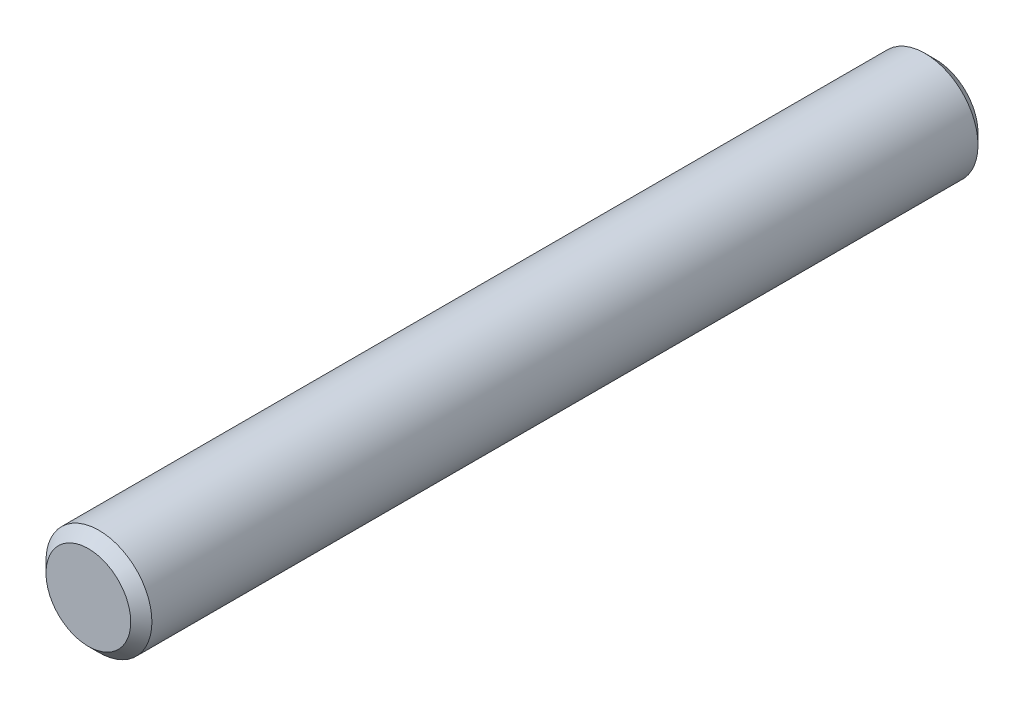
ISO-10303-21;
HEADER;
FILE_DESCRIPTION(('STEP AP214'),'2;1');
FILE_NAME('part.step','',(''),(''),'','','');
FILE_SCHEMA(('AUTOMOTIVE_DESIGN { 1 0 10303 214 1 1 1 1 }'));
ENDSEC;
DATA;
#1=APPLICATION_CONTEXT('core data for automotive mechanical design processes');
#2=APPLICATION_PROTOCOL_DEFINITION('international standard','automotive_design',2000,#1);
#3=PRODUCT_CONTEXT('',#1,'mechanical');
#4=PRODUCT('Part','Part','',(#3));
#5=PRODUCT_RELATED_PRODUCT_CATEGORY('part','',(#4));
#6=PRODUCT_DEFINITION_FORMATION('','',#4);
#7=PRODUCT_DEFINITION_CONTEXT('part definition',#1,'design');
#8=PRODUCT_DEFINITION('design','',#6,#7);
#9=PRODUCT_DEFINITION_SHAPE('','',#8);
#10=(LENGTH_UNIT() NAMED_UNIT(*) SI_UNIT(.MILLI.,.METRE.));
#11=(NAMED_UNIT(*) PLANE_ANGLE_UNIT() SI_UNIT($,.RADIAN.));
#12=(NAMED_UNIT(*) SI_UNIT($,.STERADIAN.) SOLID_ANGLE_UNIT());
#13=UNCERTAINTY_MEASURE_WITH_UNIT(LENGTH_MEASURE(1.E-05),#10,'distance_accuracy_value','');
#14=(GEOMETRIC_REPRESENTATION_CONTEXT(3) GLOBAL_UNCERTAINTY_ASSIGNED_CONTEXT((#13)) GLOBAL_UNIT_ASSIGNED_CONTEXT((#10,
#11,#12)) REPRESENTATION_CONTEXT('',''));
#15=CARTESIAN_POINT('',(0.,0.,0.));
#16=DIRECTION('',(0.,0.,1.));
#17=DIRECTION('',(1.,0.,0.));
#18=AXIS2_PLACEMENT_3D('',#15,#16,#17);
#19=CARTESIAN_POINT('',(0.,0.,20.));
#20=DIRECTION('',(0.,0.,-1.));
#21=DIRECTION('',(-1.,0.,0.));
#22=AXIS2_PLACEMENT_3D('',#19,#20,#21);
#23=CYLINDRICAL_SURFACE('',#22,2.5);
#24=CARTESIAN_POINT('',(0.,0.,-19.5));
#25=DIRECTION('',(0.,0.,1.));
#26=DIRECTION('',(1.,0.,0.));
#27=AXIS2_PLACEMENT_3D('',#24,#25,#26);
#28=CIRCLE('',#27,2.5);
#29=CARTESIAN_POINT('',(2.5,0.,-19.5));
#30=VERTEX_POINT('',#29);
#31=EDGE_CURVE('E53',#30,#30,#28,.T.);
#32=ORIENTED_EDGE('',*,*,#31,.T.);
#33=EDGE_LOOP('',(#32));
#34=FACE_BOUND('',#33,.T.);
#35=CARTESIAN_POINT('',(0.,0.,19.5));
#36=DIRECTION('',(0.,0.,1.));
#37=DIRECTION('',(1.,0.,0.));
#38=AXIS2_PLACEMENT_3D('',#35,#36,#37);
#39=CIRCLE('',#38,2.5);
#40=CARTESIAN_POINT('',(2.5,0.,19.5));
#41=VERTEX_POINT('',#40);
#42=EDGE_CURVE('E57',#41,#41,#39,.F.);
#43=ORIENTED_EDGE('',*,*,#42,.T.);
#44=EDGE_LOOP('',(#43));
#45=FACE_BOUND('',#44,.T.);
#46=ADVANCED_FACE('F42',(#34,#45),#23,.T.);
#47=CARTESIAN_POINT('',(0.,0.,20.));
#48=DIRECTION('',(0.,0.,1.));
#49=DIRECTION('',(1.,0.,0.));
#50=AXIS2_PLACEMENT_3D('',#47,#48,#49);
#51=PLANE('',#50);
#52=CARTESIAN_POINT('',(0.,0.,20.));
#53=DIRECTION('',(0.,0.,1.));
#54=DIRECTION('',(1.,0.,0.));
#55=AXIS2_PLACEMENT_3D('',#52,#53,#54);
#56=CIRCLE('',#55,1.99999999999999);
#57=CARTESIAN_POINT('',(1.99999999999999,0.,20.));
#58=VERTEX_POINT('',#57);
#59=EDGE_CURVE('E12',#58,#58,#56,.T.);
#60=ORIENTED_EDGE('',*,*,#59,.T.);
#61=EDGE_LOOP('',(#60));
#62=FACE_BOUND('',#61,.T.);
#63=ADVANCED_FACE('F73',(#62),#51,.T.);
#64=CARTESIAN_POINT('',(0.,0.,-20.));
#65=DIRECTION('',(0.,0.,1.));
#66=DIRECTION('',(1.,0.,0.));
#67=AXIS2_PLACEMENT_3D('',#64,#65,#66);
#68=PLANE('',#67);
#69=CARTESIAN_POINT('',(0.,0.,-20.));
#70=DIRECTION('',(0.,0.,1.));
#71=DIRECTION('',(1.,0.,0.));
#72=AXIS2_PLACEMENT_3D('',#69,#70,#71);
#73=CIRCLE('',#72,2.);
#74=CARTESIAN_POINT('',(2.,0.,-20.));
#75=VERTEX_POINT('',#74);
#76=EDGE_CURVE('E49',#75,#75,#73,.F.);
#77=ORIENTED_EDGE('',*,*,#76,.T.);
#78=EDGE_LOOP('',(#77));
#79=FACE_BOUND('',#78,.T.);
#80=ADVANCED_FACE('F70',(#79),#68,.F.);
#81=CARTESIAN_POINT('',(0.,0.,-19.5));
#82=DIRECTION('',(0.,0.,1.));
#83=DIRECTION('',(1.,0.,0.));
#84=AXIS2_PLACEMENT_3D('',#81,#82,#83);
#85=CONICAL_SURFACE('',#84,2.5,0.785398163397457);
#86=ORIENTED_EDGE('',*,*,#76,.F.);
#87=EDGE_LOOP('',(#86));
#88=FACE_BOUND('',#87,.T.);
#89=ORIENTED_EDGE('',*,*,#31,.F.);
#90=EDGE_LOOP('',(#89));
#91=FACE_BOUND('',#90,.T.);
#92=ADVANCED_FACE('F66',(#88,#91),#85,.T.);
#93=CARTESIAN_POINT('',(0.,0.,20.));
#94=DIRECTION('',(0.,0.,-1.));
#95=DIRECTION('',(-1.,0.,0.));
#96=AXIS2_PLACEMENT_3D('',#93,#94,#95);
#97=CONICAL_SURFACE('',#96,1.99999999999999,0.78539816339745);
#98=ORIENTED_EDGE('',*,*,#42,.F.);
#99=EDGE_LOOP('',(#98));
#100=FACE_BOUND('',#99,.T.);
#101=ORIENTED_EDGE('',*,*,#59,.F.);
#102=EDGE_LOOP('',(#101));
#103=FACE_BOUND('',#102,.T.);
#104=ADVANCED_FACE('F44',(#100,#103),#97,.T.);
#105=CLOSED_SHELL('',(#46,#63,#80,#92,#104));
#106=MANIFOLD_SOLID_BREP('B2',#105);
#107=ADVANCED_BREP_SHAPE_REPRESENTATION('',(#18,#106),#14);
#108=SHAPE_DEFINITION_REPRESENTATION(#9,#107);
ENDSEC;
END-ISO-10303-21;
